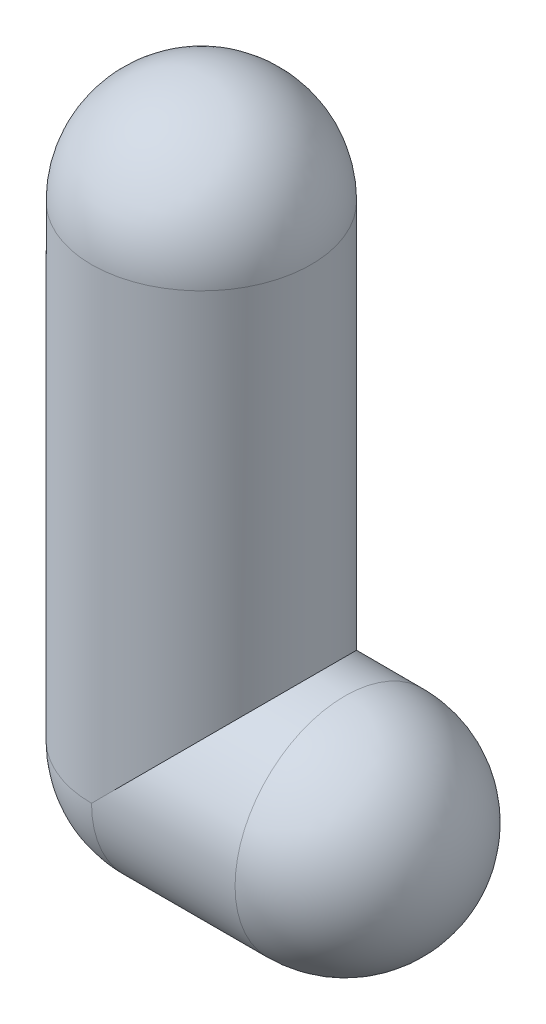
ISO-10303-21;
HEADER;
FILE_DESCRIPTION(('STEP AP214'),'2;1');
FILE_NAME('part.step','',(''),(''),'','','');
FILE_SCHEMA(('AUTOMOTIVE_DESIGN { 1 0 10303 214 1 1 1 1 }'));
ENDSEC;
DATA;
#1=APPLICATION_CONTEXT('core data for automotive mechanical design processes');
#2=APPLICATION_PROTOCOL_DEFINITION('international standard','automotive_design',2000,#1);
#3=PRODUCT_CONTEXT('',#1,'mechanical');
#4=PRODUCT('Part','Part','',(#3));
#5=PRODUCT_RELATED_PRODUCT_CATEGORY('part','',(#4));
#6=PRODUCT_DEFINITION_FORMATION('','',#4);
#7=PRODUCT_DEFINITION_CONTEXT('part definition',#1,'design');
#8=PRODUCT_DEFINITION('design','',#6,#7);
#9=PRODUCT_DEFINITION_SHAPE('','',#8);
#10=(LENGTH_UNIT() NAMED_UNIT(*) SI_UNIT(.MILLI.,.METRE.));
#11=(NAMED_UNIT(*) PLANE_ANGLE_UNIT() SI_UNIT($,.RADIAN.));
#12=(NAMED_UNIT(*) SI_UNIT($,.STERADIAN.) SOLID_ANGLE_UNIT());
#13=UNCERTAINTY_MEASURE_WITH_UNIT(LENGTH_MEASURE(1.E-05),#10,'distance_accuracy_value','');
#14=(GEOMETRIC_REPRESENTATION_CONTEXT(3) GLOBAL_UNCERTAINTY_ASSIGNED_CONTEXT((#13)) GLOBAL_UNIT_ASSIGNED_CONTEXT((#10,
#11,#12)) REPRESENTATION_CONTEXT('',''));
#15=CARTESIAN_POINT('',(0.,0.,0.));
#16=DIRECTION('',(0.,0.,1.));
#17=DIRECTION('',(1.,0.,0.));
#18=AXIS2_PLACEMENT_3D('',#15,#16,#17);
#19=CARTESIAN_POINT('',(-10.,-135.,0.));
#20=DIRECTION('',(0.,1.,0.));
#21=DIRECTION('',(0.,0.,-1.));
#22=AXIS2_PLACEMENT_3D('',#19,#20,#21);
#23=CYLINDRICAL_SURFACE('',#22,1.53);
#24=CARTESIAN_POINT('',(-10.,-128.5,0.));
#25=DIRECTION('',(0.,1.,0.));
#26=DIRECTION('',(-1.,0.,0.));
#27=AXIS2_PLACEMENT_3D('',#24,#25,#26);
#28=CIRCLE('',#27,1.53);
#29=CARTESIAN_POINT('',(-10.,-128.5,-1.53));
#30=VERTEX_POINT('',#29);
#31=CARTESIAN_POINT('',(-10.,-128.5,1.53));
#32=VERTEX_POINT('',#31);
#33=EDGE_CURVE('E67',#30,#32,#28,.T.);
#34=ORIENTED_EDGE('',*,*,#33,.F.);
#35=CARTESIAN_POINT('',(-10.,-128.5,0.));
#36=DIRECTION('',(0.,-1.,0.));
#37=DIRECTION('',(1.,0.,0.));
#38=AXIS2_PLACEMENT_3D('',#35,#36,#37);
#39=CIRCLE('',#38,1.53);
#40=EDGE_CURVE('E37',#30,#32,#39,.T.);
#41=ORIENTED_EDGE('',*,*,#40,.T.);
#42=EDGE_LOOP('',(#34,#41));
#43=FACE_BOUND('',#42,.T.);
#44=CARTESIAN_POINT('',(-10.,-135.,0.));
#45=DIRECTION('',(-0.707106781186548,0.707106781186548,0.));
#46=DIRECTION('',(0.707106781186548,0.707106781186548,0.));
#47=AXIS2_PLACEMENT_3D('',#44,#45,#46);
#48=ELLIPSE('',#47,2.16374675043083,1.53);
#49=CARTESIAN_POINT('',(-10.,-135.,-1.53));
#50=VERTEX_POINT('',#49);
#51=CARTESIAN_POINT('',(-10.,-135.,1.53));
#52=VERTEX_POINT('',#51);
#53=EDGE_CURVE('E24',#50,#52,#48,.F.);
#54=ORIENTED_EDGE('',*,*,#53,.F.);
#55=CARTESIAN_POINT('',(-10.,-135.,0.));
#56=DIRECTION('',(0.,-1.,0.));
#57=DIRECTION('',(-1.,0.,0.));
#58=AXIS2_PLACEMENT_3D('',#55,#56,#57);
#59=CIRCLE('',#58,1.53);
#60=EDGE_CURVE('E11',#52,#50,#59,.T.);
#61=ORIENTED_EDGE('',*,*,#60,.F.);
#62=EDGE_LOOP('',(#54,#61));
#63=FACE_BOUND('',#62,.T.);
#64=ADVANCED_FACE('F16',(#43,#63),#23,.T.);
#65=CARTESIAN_POINT('',(-10.,-135.,0.));
#66=DIRECTION('',(0.,0.,1.));
#67=DIRECTION('',(0.,1.,0.));
#68=AXIS2_PLACEMENT_3D('',#65,#66,#67);
#69=SPHERICAL_SURFACE('',#68,1.53);
#70=CARTESIAN_POINT('',(-10.,-135.,0.));
#71=DIRECTION('',(1.,0.,0.));
#72=DIRECTION('',(0.,-1.,0.));
#73=AXIS2_PLACEMENT_3D('',#70,#71,#72);
#74=CIRCLE('',#73,1.53);
#75=EDGE_CURVE('E70',#52,#50,#74,.T.);
#76=ORIENTED_EDGE('',*,*,#75,.F.);
#77=ORIENTED_EDGE('',*,*,#60,.T.);
#78=EDGE_LOOP('',(#76,#77));
#79=FACE_BOUND('',#78,.T.);
#80=ADVANCED_FACE('F85',(#79),#69,.T.);
#81=CARTESIAN_POINT('',(-8.,-135.,0.));
#82=DIRECTION('',(-1.,0.,0.));
#83=DIRECTION('',(0.,0.,-1.));
#84=AXIS2_PLACEMENT_3D('',#81,#82,#83);
#85=CYLINDRICAL_SURFACE('',#84,1.53);
#86=ORIENTED_EDGE('',*,*,#75,.T.);
#87=ORIENTED_EDGE('',*,*,#53,.T.);
#88=EDGE_LOOP('',(#86,#87));
#89=FACE_BOUND('',#88,.T.);
#90=CARTESIAN_POINT('',(-8.,-135.,0.));
#91=DIRECTION('',(-1.,0.,0.));
#92=DIRECTION('',(0.,-1.,0.));
#93=AXIS2_PLACEMENT_3D('',#90,#91,#92);
#94=CIRCLE('',#93,1.53);
#95=CARTESIAN_POINT('',(-8.,-135.,-1.53));
#96=VERTEX_POINT('',#95);
#97=CARTESIAN_POINT('',(-8.,-135.,1.53));
#98=VERTEX_POINT('',#97);
#99=EDGE_CURVE('E50',#96,#98,#94,.T.);
#100=ORIENTED_EDGE('',*,*,#99,.T.);
#101=CARTESIAN_POINT('',(-8.,-135.,0.));
#102=DIRECTION('',(1.,0.,0.));
#103=DIRECTION('',(0.,1.,0.));
#104=AXIS2_PLACEMENT_3D('',#101,#102,#103);
#105=CIRCLE('',#104,1.53);
#106=EDGE_CURVE('E30',#96,#98,#105,.T.);
#107=ORIENTED_EDGE('',*,*,#106,.F.);
#108=EDGE_LOOP('',(#100,#107));
#109=FACE_BOUND('',#108,.T.);
#110=ADVANCED_FACE('F49',(#89,#109),#85,.T.);
#111=CARTESIAN_POINT('',(-10.,-128.5,0.));
#112=DIRECTION('',(0.,0.,1.));
#113=DIRECTION('',(-1.,0.,0.));
#114=AXIS2_PLACEMENT_3D('',#111,#112,#113);
#115=SPHERICAL_SURFACE('',#114,1.53);
#116=CARTESIAN_POINT('',(-10.,-128.5,0.));
#117=DIRECTION('',(0.,1.,0.));
#118=DIRECTION('',(-1.,0.,0.));
#119=AXIS2_PLACEMENT_3D('',#116,#117,#118);
#120=SPHERICAL_SURFACE('',#119,1.53);
#121=ORIENTED_EDGE('',*,*,#33,.T.);
#122=ORIENTED_EDGE('',*,*,#40,.F.);
#123=EDGE_LOOP('',(#121,#122));
#124=FACE_BOUND('',#123,.T.);
#125=ADVANCED_FACE('F92',(#124),#120,.T.);
#126=CARTESIAN_POINT('',(-8.,-135.,0.));
#127=DIRECTION('',(0.,0.,1.));
#128=DIRECTION('',(0.,1.,0.));
#129=AXIS2_PLACEMENT_3D('',#126,#127,#128);
#130=SPHERICAL_SURFACE('',#129,1.53);
#131=CARTESIAN_POINT('',(-8.,-135.,0.));
#132=DIRECTION('',(1.,0.,0.));
#133=DIRECTION('',(0.,1.,0.));
#134=AXIS2_PLACEMENT_3D('',#131,#132,#133);
#135=SPHERICAL_SURFACE('',#134,1.53);
#136=ORIENTED_EDGE('',*,*,#106,.T.);
#137=ORIENTED_EDGE('',*,*,#99,.F.);
#138=EDGE_LOOP('',(#136,#137));
#139=FACE_BOUND('',#138,.T.);
#140=ADVANCED_FACE('F53',(#139),#135,.T.);
#141=CLOSED_SHELL('',(#64,#80,#110,#125,#140));
#142=MANIFOLD_SOLID_BREP('B1',#141);
#143=ADVANCED_BREP_SHAPE_REPRESENTATION('',(#18,#142),#14);
#144=SHAPE_DEFINITION_REPRESENTATION(#9,#143);
ENDSEC;
END-ISO-10303-21;
